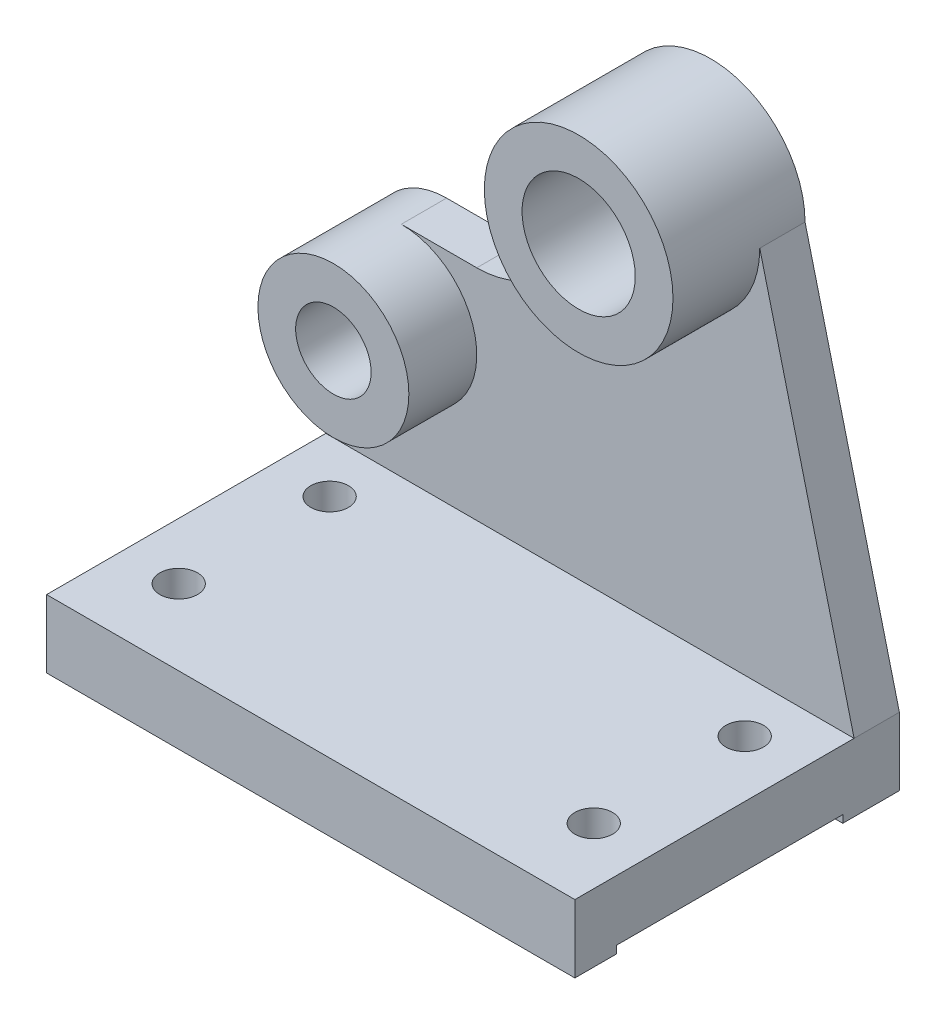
ISO-10303-21;
HEADER;
FILE_DESCRIPTION(('STEP AP214'),'2;1');
FILE_NAME('part.step','',(''),(''),'','','');
FILE_SCHEMA(('AUTOMOTIVE_DESIGN { 1 0 10303 214 1 1 1 1 }'));
ENDSEC;
DATA;
#1=APPLICATION_CONTEXT('core data for automotive mechanical design processes');
#2=APPLICATION_PROTOCOL_DEFINITION('international standard','automotive_design',2000,#1);
#3=PRODUCT_CONTEXT('',#1,'mechanical');
#4=PRODUCT('Part','Part','',(#3));
#5=PRODUCT_RELATED_PRODUCT_CATEGORY('part','',(#4));
#6=PRODUCT_DEFINITION_FORMATION('','',#4);
#7=PRODUCT_DEFINITION_CONTEXT('part definition',#1,'design');
#8=PRODUCT_DEFINITION('design','',#6,#7);
#9=PRODUCT_DEFINITION_SHAPE('','',#8);
#10=(LENGTH_UNIT() NAMED_UNIT(*) SI_UNIT(.MILLI.,.METRE.));
#11=(NAMED_UNIT(*) PLANE_ANGLE_UNIT() SI_UNIT($,.RADIAN.));
#12=(NAMED_UNIT(*) SI_UNIT($,.STERADIAN.) SOLID_ANGLE_UNIT());
#13=UNCERTAINTY_MEASURE_WITH_UNIT(LENGTH_MEASURE(1.E-05),#10,'distance_accuracy_value','');
#14=(GEOMETRIC_REPRESENTATION_CONTEXT(3) GLOBAL_UNCERTAINTY_ASSIGNED_CONTEXT((#13)) GLOBAL_UNIT_ASSIGNED_CONTEXT((#10,
#11,#12)) REPRESENTATION_CONTEXT('',''));
#15=CARTESIAN_POINT('',(0.,0.,0.));
#16=DIRECTION('',(0.,0.,1.));
#17=DIRECTION('',(1.,0.,0.));
#18=AXIS2_PLACEMENT_3D('',#15,#16,#17);
#19=CARTESIAN_POINT('',(11.4744833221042,0.,86.));
#20=DIRECTION('',(0.,1.,0.));
#21=DIRECTION('',(-1.,0.,0.));
#22=AXIS2_PLACEMENT_3D('',#19,#20,#21);
#23=PLANE('',#22);
#24=DIRECTION('',(0.,0.,-1.));
#25=VECTOR('',#24,1.);
#26=CARTESIAN_POINT('',(-70.,0.,86.));
#27=LINE('',#26,#25);
#28=CARTESIAN_POINT('',(-70.,0.,86.));
#29=VERTEX_POINT('',#28);
#30=CARTESIAN_POINT('',(-70.,0.,75.));
#31=VERTEX_POINT('',#30);
#32=EDGE_CURVE('E156',#29,#31,#27,.T.);
#33=ORIENTED_EDGE('',*,*,#32,.T.);
#34=DIRECTION('',(1.,0.,0.));
#35=VECTOR('',#34,1.);
#36=CARTESIAN_POINT('',(-70.00005,0.,75.));
#37=LINE('',#36,#35);
#38=CARTESIAN_POINT('',(70.,0.,75.));
#39=VERTEX_POINT('',#38);
#40=EDGE_CURVE('E140',#31,#39,#37,.T.);
#41=ORIENTED_EDGE('',*,*,#40,.T.);
#42=DIRECTION('',(0.,0.,-1.));
#43=VECTOR('',#42,1.);
#44=CARTESIAN_POINT('',(70.,0.,86.));
#45=LINE('',#44,#43);
#46=CARTESIAN_POINT('',(70.,0.,86.));
#47=VERTEX_POINT('',#46);
#48=EDGE_CURVE('E155',#47,#39,#45,.T.);
#49=ORIENTED_EDGE('',*,*,#48,.F.);
#50=DIRECTION('',(1.,0.,0.));
#51=VECTOR('',#50,1.);
#52=CARTESIAN_POINT('',(11.4744833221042,0.,86.));
#53=LINE('',#52,#51);
#54=EDGE_CURVE('E182',#29,#47,#53,.T.);
#55=ORIENTED_EDGE('',*,*,#54,.F.);
#56=EDGE_LOOP('',(#33,#41,#49,#55));
#57=FACE_BOUND('',#56,.T.);
#58=ADVANCED_FACE('F33',(#57),#23,.F.);
#59=CARTESIAN_POINT('',(70.,0.,15.));
#60=VERTEX_POINT('',#59);
#61=CARTESIAN_POINT('',(70.,0.,0.));
#62=VERTEX_POINT('',#61);
#63=EDGE_CURVE('E165',#60,#62,#45,.T.);
#64=ORIENTED_EDGE('',*,*,#63,.F.);
#65=DIRECTION('',(1.,0.,0.));
#66=VECTOR('',#65,1.);
#67=CARTESIAN_POINT('',(-70.00005,0.,15.));
#68=LINE('',#67,#66);
#69=CARTESIAN_POINT('',(-70.,0.,15.));
#70=VERTEX_POINT('',#69);
#71=EDGE_CURVE('E157',#70,#60,#68,.T.);
#72=ORIENTED_EDGE('',*,*,#71,.F.);
#73=CARTESIAN_POINT('',(-70.,0.,0.));
#74=VERTEX_POINT('',#73);
#75=EDGE_CURVE('E179',#70,#74,#27,.T.);
#76=ORIENTED_EDGE('',*,*,#75,.T.);
#77=DIRECTION('',(1.,0.,0.));
#78=VECTOR('',#77,1.);
#79=CARTESIAN_POINT('',(11.4744833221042,0.,0.));
#80=LINE('',#79,#78);
#81=EDGE_CURVE('E185',#74,#62,#80,.T.);
#82=ORIENTED_EDGE('',*,*,#81,.T.);
#83=EDGE_LOOP('',(#64,#72,#76,#82));
#84=FACE_BOUND('',#83,.T.);
#85=ADVANCED_FACE('F35',(#84),#23,.F.);
#86=CARTESIAN_POINT('',(70.,-156.788360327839,86.));
#87=DIRECTION('',(-1.,0.,0.));
#88=DIRECTION('',(0.,0.,1.));
#89=AXIS2_PLACEMENT_3D('',#86,#87,#88);
#90=PLANE('',#89);
#91=ORIENTED_EDGE('',*,*,#48,.T.);
#92=DIRECTION('',(0.,-1.,0.));
#93=VECTOR('',#92,1.);
#94=CARTESIAN_POINT('',(70.,0.,75.));
#95=LINE('',#94,#93);
#96=CARTESIAN_POINT('',(70.,2.00000000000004,75.));
#97=VERTEX_POINT('',#96);
#98=EDGE_CURVE('E137',#97,#39,#95,.T.);
#99=ORIENTED_EDGE('',*,*,#98,.F.);
#100=DIRECTION('',(0.,0.,1.));
#101=VECTOR('',#100,1.);
#102=CARTESIAN_POINT('',(70.,2.00000000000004,75.));
#103=LINE('',#102,#101);
#104=CARTESIAN_POINT('',(70.,2.00000000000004,15.));
#105=VERTEX_POINT('',#104);
#106=EDGE_CURVE('E158',#105,#97,#103,.T.);
#107=ORIENTED_EDGE('',*,*,#106,.F.);
#108=DIRECTION('',(0.,1.,0.));
#109=VECTOR('',#108,1.);
#110=CARTESIAN_POINT('',(70.,0.,15.));
#111=LINE('',#110,#109);
#112=EDGE_CURVE('E148',#60,#105,#111,.T.);
#113=ORIENTED_EDGE('',*,*,#112,.F.);
#114=ORIENTED_EDGE('',*,*,#63,.T.);
#115=DIRECTION('',(0.,1.,0.));
#116=VECTOR('',#115,1.);
#117=CARTESIAN_POINT('',(70.,-156.788360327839,0.));
#118=LINE('',#117,#116);
#119=CARTESIAN_POINT('',(70.,18.,0.));
#120=VERTEX_POINT('',#119);
#121=EDGE_CURVE('E183',#62,#120,#118,.T.);
#122=ORIENTED_EDGE('',*,*,#121,.T.);
#123=DIRECTION('',(0.,0.,-1.));
#124=VECTOR('',#123,1.);
#125=CARTESIAN_POINT('',(70.,18.,12.));
#126=LINE('',#125,#124);
#127=CARTESIAN_POINT('',(70.,18.,12.));
#128=VERTEX_POINT('',#127);
#129=EDGE_CURVE('E204',#128,#120,#126,.T.);
#130=ORIENTED_EDGE('',*,*,#129,.F.);
#131=DIRECTION('',(0.,0.,-1.));
#132=VECTOR('',#131,1.);
#133=CARTESIAN_POINT('',(70.,18.,86.));
#134=LINE('',#133,#132);
#135=CARTESIAN_POINT('',(70.,18.,86.));
#136=VERTEX_POINT('',#135);
#137=EDGE_CURVE('E168',#136,#128,#134,.T.);
#138=ORIENTED_EDGE('',*,*,#137,.F.);
#139=DIRECTION('',(0.,1.,0.));
#140=VECTOR('',#139,1.);
#141=CARTESIAN_POINT('',(70.,-156.788360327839,86.));
#142=LINE('',#141,#140);
#143=EDGE_CURVE('E162',#47,#136,#142,.T.);
#144=ORIENTED_EDGE('',*,*,#143,.F.);
#145=EDGE_LOOP('',(#91,#99,#107,#113,#114,#122,#130,#138,#144));
#146=FACE_BOUND('',#145,.T.);
#147=ADVANCED_FACE('F160',(#146),#90,.F.);
#148=CARTESIAN_POINT('',(11.4744833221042,18.,86.));
#149=DIRECTION('',(0.,1.,0.));
#150=DIRECTION('',(-1.,0.,0.));
#151=AXIS2_PLACEMENT_3D('',#148,#149,#150);
#152=PLANE('',#151);
#153=CARTESIAN_POINT('',(55.,18.,26.));
#154=DIRECTION('',(0.,1.,0.));
#155=DIRECTION('',(-1.,0.,0.));
#156=AXIS2_PLACEMENT_3D('',#153,#154,#155);
#157=CIRCLE('',#156,5.);
#158=CARTESIAN_POINT('',(50.,18.,26.));
#159=VERTEX_POINT('',#158);
#160=EDGE_CURVE('E269',#159,#159,#157,.T.);
#161=ORIENTED_EDGE('',*,*,#160,.F.);
#162=EDGE_LOOP('',(#161));
#163=FACE_BOUND('',#162,.T.);
#164=CARTESIAN_POINT('',(55.,18.,66.));
#165=DIRECTION('',(0.,1.,0.));
#166=DIRECTION('',(-1.,0.,0.));
#167=AXIS2_PLACEMENT_3D('',#164,#165,#166);
#168=CIRCLE('',#167,5.);
#169=CARTESIAN_POINT('',(50.,18.,66.));
#170=VERTEX_POINT('',#169);
#171=EDGE_CURVE('E259',#170,#170,#168,.T.);
#172=ORIENTED_EDGE('',*,*,#171,.F.);
#173=EDGE_LOOP('',(#172));
#174=FACE_BOUND('',#173,.T.);
#175=CARTESIAN_POINT('',(-55.,18.,26.));
#176=DIRECTION('',(0.,1.,0.));
#177=DIRECTION('',(-1.,0.,0.));
#178=AXIS2_PLACEMENT_3D('',#175,#176,#177);
#179=CIRCLE('',#178,5.);
#180=CARTESIAN_POINT('',(-60.,18.,26.));
#181=VERTEX_POINT('',#180);
#182=EDGE_CURVE('E256',#181,#181,#179,.T.);
#183=ORIENTED_EDGE('',*,*,#182,.F.);
#184=EDGE_LOOP('',(#183));
#185=FACE_BOUND('',#184,.T.);
#186=CARTESIAN_POINT('',(-55.,18.,66.));
#187=DIRECTION('',(0.,1.,0.));
#188=DIRECTION('',(-1.,0.,0.));
#189=AXIS2_PLACEMENT_3D('',#186,#187,#188);
#190=CIRCLE('',#189,5.);
#191=CARTESIAN_POINT('',(-60.,18.,66.));
#192=VERTEX_POINT('',#191);
#193=EDGE_CURVE('E253',#192,#192,#190,.T.);
#194=ORIENTED_EDGE('',*,*,#193,.F.);
#195=EDGE_LOOP('',(#194));
#196=FACE_BOUND('',#195,.T.);
#197=DIRECTION('',(1.,0.,0.));
#198=VECTOR('',#197,1.);
#199=CARTESIAN_POINT('',(11.4744833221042,18.,12.));
#200=LINE('',#199,#198);
#201=CARTESIAN_POINT('',(-70.,18.,12.));
#202=VERTEX_POINT('',#201);
#203=EDGE_CURVE('E58',#202,#128,#200,.T.);
#204=ORIENTED_EDGE('',*,*,#203,.F.);
#205=DIRECTION('',(0.,0.,-1.));
#206=VECTOR('',#205,1.);
#207=CARTESIAN_POINT('',(-70.,18.,86.));
#208=LINE('',#207,#206);
#209=CARTESIAN_POINT('',(-70.,18.,86.));
#210=VERTEX_POINT('',#209);
#211=EDGE_CURVE('E173',#210,#202,#208,.T.);
#212=ORIENTED_EDGE('',*,*,#211,.F.);
#213=DIRECTION('',(1.,0.,0.));
#214=VECTOR('',#213,1.);
#215=CARTESIAN_POINT('',(11.4744833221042,18.,86.));
#216=LINE('',#215,#214);
#217=EDGE_CURVE('E192',#210,#136,#216,.T.);
#218=ORIENTED_EDGE('',*,*,#217,.T.);
#219=ORIENTED_EDGE('',*,*,#137,.T.);
#220=EDGE_LOOP('',(#204,#212,#218,#219));
#221=FACE_BOUND('',#220,.T.);
#222=ADVANCED_FACE('F321',(#163,#174,#185,#196,#221),#152,.T.);
#223=CARTESIAN_POINT('',(-70.,-156.788360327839,86.));
#224=DIRECTION('',(-1.,0.,0.));
#225=DIRECTION('',(0.,0.,1.));
#226=AXIS2_PLACEMENT_3D('',#223,#224,#225);
#227=PLANE('',#226);
#228=DIRECTION('',(0.,1.,0.));
#229=VECTOR('',#228,1.);
#230=CARTESIAN_POINT('',(-70.,-156.788360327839,75.));
#231=LINE('',#230,#229);
#232=CARTESIAN_POINT('',(-70.,2.00000000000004,75.));
#233=VERTEX_POINT('',#232);
#234=EDGE_CURVE('E11',#31,#233,#231,.T.);
#235=ORIENTED_EDGE('',*,*,#234,.F.);
#236=ORIENTED_EDGE('',*,*,#32,.F.);
#237=DIRECTION('',(0.,1.,0.));
#238=VECTOR('',#237,1.);
#239=CARTESIAN_POINT('',(-70.,-156.788360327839,86.));
#240=LINE('',#239,#238);
#241=EDGE_CURVE('E189',#29,#210,#240,.T.);
#242=ORIENTED_EDGE('',*,*,#241,.T.);
#243=ORIENTED_EDGE('',*,*,#211,.T.);
#244=DIRECTION('',(0.,1.,0.));
#245=VECTOR('',#244,1.);
#246=CARTESIAN_POINT('',(-70.,-156.788360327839,12.));
#247=LINE('',#246,#245);
#248=CARTESIAN_POINT('',(-70.,56.,12.));
#249=VERTEX_POINT('',#248);
#250=EDGE_CURVE('E237',#202,#249,#247,.T.);
#251=ORIENTED_EDGE('',*,*,#250,.T.);
#252=DIRECTION('',(0.,0.,-1.));
#253=VECTOR('',#252,1.);
#254=CARTESIAN_POINT('',(-70.,56.,12.));
#255=LINE('',#254,#253);
#256=CARTESIAN_POINT('',(-70.,56.,0.));
#257=VERTEX_POINT('',#256);
#258=EDGE_CURVE('E201',#249,#257,#255,.T.);
#259=ORIENTED_EDGE('',*,*,#258,.T.);
#260=DIRECTION('',(0.,1.,0.));
#261=VECTOR('',#260,1.);
#262=CARTESIAN_POINT('',(-70.,-156.788360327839,0.));
#263=LINE('',#262,#261);
#264=EDGE_CURVE('E180',#74,#257,#263,.T.);
#265=ORIENTED_EDGE('',*,*,#264,.F.);
#266=ORIENTED_EDGE('',*,*,#75,.F.);
#267=DIRECTION('',(0.,-1.,0.));
#268=VECTOR('',#267,1.);
#269=CARTESIAN_POINT('',(-70.,-156.788360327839,15.));
#270=LINE('',#269,#268);
#271=CARTESIAN_POINT('',(-70.,2.00000000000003,15.));
#272=VERTEX_POINT('',#271);
#273=EDGE_CURVE('E164',#272,#70,#270,.T.);
#274=ORIENTED_EDGE('',*,*,#273,.F.);
#275=DIRECTION('',(0.,0.,-1.));
#276=VECTOR('',#275,1.);
#277=CARTESIAN_POINT('',(-70.,2.00000000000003,86.));
#278=LINE('',#277,#276);
#279=EDGE_CURVE('E42',#233,#272,#278,.T.);
#280=ORIENTED_EDGE('',*,*,#279,.F.);
#281=EDGE_LOOP('',(#235,#236,#242,#243,#251,#259,#265,#266,#274,#280));
#282=FACE_BOUND('',#281,.T.);
#283=ADVANCED_FACE('F317',(#282),#227,.T.);
#284=CARTESIAN_POINT('',(11.4744833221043,-156.788360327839,86.));
#285=DIRECTION('',(0.,0.,1.));
#286=DIRECTION('',(1.,0.,0.));
#287=AXIS2_PLACEMENT_3D('',#284,#285,#286);
#288=PLANE('',#287);
#289=ORIENTED_EDGE('',*,*,#54,.T.);
#290=ORIENTED_EDGE('',*,*,#143,.T.);
#291=ORIENTED_EDGE('',*,*,#217,.F.);
#292=ORIENTED_EDGE('',*,*,#241,.F.);
#293=EDGE_LOOP('',(#289,#290,#291,#292));
#294=FACE_BOUND('',#293,.T.);
#295=ADVANCED_FACE('F323',(#294),#288,.T.);
#296=CARTESIAN_POINT('',(11.4744833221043,-156.788360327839,0.));
#297=DIRECTION('',(0.,0.,1.));
#298=DIRECTION('',(1.,0.,0.));
#299=AXIS2_PLACEMENT_3D('',#296,#297,#298);
#300=PLANE('',#299);
#301=ORIENTED_EDGE('',*,*,#81,.F.);
#302=ORIENTED_EDGE('',*,*,#264,.T.);
#303=CARTESIAN_POINT('',(-50.,56.,0.));
#304=DIRECTION('',(0.,0.,1.));
#305=DIRECTION('',(1.,0.,0.));
#306=AXIS2_PLACEMENT_3D('',#303,#304,#305);
#307=CIRCLE('',#306,20.);
#308=CARTESIAN_POINT('',(-50.,76.,0.));
#309=VERTEX_POINT('',#308);
#310=EDGE_CURVE('E284',#309,#257,#307,.T.);
#311=ORIENTED_EDGE('',*,*,#310,.F.);
#312=DIRECTION('',(1.,0.,0.));
#313=VECTOR('',#312,1.);
#314=CARTESIAN_POINT('',(11.4744833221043,76.,0.));
#315=LINE('',#314,#313);
#316=CARTESIAN_POINT('',(-30.,76.,0.));
#317=VERTEX_POINT('',#316);
#318=EDGE_CURVE('E219',#309,#317,#315,.T.);
#319=ORIENTED_EDGE('',*,*,#318,.T.);
#320=CARTESIAN_POINT('',(-30.,101.,0.));
#321=DIRECTION('',(0.,0.,1.));
#322=DIRECTION('',(1.,0.,0.));
#323=AXIS2_PLACEMENT_3D('',#320,#321,#322);
#324=CIRCLE('',#323,25.);
#325=CARTESIAN_POINT('',(-5.00000000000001,101.,0.));
#326=VERTEX_POINT('',#325);
#327=EDGE_CURVE('E222',#317,#326,#324,.T.);
#328=ORIENTED_EDGE('',*,*,#327,.T.);
#329=DIRECTION('',(0.,1.,0.));
#330=VECTOR('',#329,1.);
#331=CARTESIAN_POINT('',(-5.00000000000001,-156.788360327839,0.));
#332=LINE('',#331,#330);
#333=CARTESIAN_POINT('',(-5.00000000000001,118.,0.));
#334=VERTEX_POINT('',#333);
#335=EDGE_CURVE('E213',#326,#334,#332,.T.);
#336=ORIENTED_EDGE('',*,*,#335,.T.);
#337=CARTESIAN_POINT('',(20.,118.,0.));
#338=DIRECTION('',(0.,0.,1.));
#339=DIRECTION('',(1.,0.,0.));
#340=AXIS2_PLACEMENT_3D('',#337,#338,#339);
#341=CIRCLE('',#340,25.);
#342=CARTESIAN_POINT('',(45.,118.,0.));
#343=VERTEX_POINT('',#342);
#344=EDGE_CURVE('E295',#343,#334,#341,.T.);
#345=ORIENTED_EDGE('',*,*,#344,.F.);
#346=DIRECTION('',(-0.242535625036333,0.970142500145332,0.));
#347=VECTOR('',#346,1.);
#348=CARTESIAN_POINT('',(107.683995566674,-132.735982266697,0.));
#349=LINE('',#348,#347);
#350=EDGE_CURVE('E217',#120,#343,#349,.T.);
#351=ORIENTED_EDGE('',*,*,#350,.F.);
#352=ORIENTED_EDGE('',*,*,#121,.F.);
#353=EDGE_LOOP('',(#301,#302,#311,#319,#328,#336,#345,#351,#352));
#354=FACE_BOUND('',#353,.T.);
#355=CARTESIAN_POINT('',(20.,118.,0.));
#356=DIRECTION('',(0.,0.,1.));
#357=DIRECTION('',(1.,0.,0.));
#358=AXIS2_PLACEMENT_3D('',#355,#356,#357);
#359=CIRCLE('',#358,15.);
#360=CARTESIAN_POINT('',(35.,118.,0.));
#361=VERTEX_POINT('',#360);
#362=EDGE_CURVE('E287',#361,#361,#359,.T.);
#363=ORIENTED_EDGE('',*,*,#362,.T.);
#364=EDGE_LOOP('',(#363));
#365=FACE_BOUND('',#364,.T.);
#366=CARTESIAN_POINT('',(-50.,56.,0.));
#367=DIRECTION('',(0.,0.,1.));
#368=DIRECTION('',(1.,0.,0.));
#369=AXIS2_PLACEMENT_3D('',#366,#367,#368);
#370=CIRCLE('',#369,10.);
#371=CARTESIAN_POINT('',(-40.,56.,0.));
#372=VERTEX_POINT('',#371);
#373=EDGE_CURVE('E277',#372,#372,#370,.T.);
#374=ORIENTED_EDGE('',*,*,#373,.T.);
#375=EDGE_LOOP('',(#374));
#376=FACE_BOUND('',#375,.T.);
#377=ADVANCED_FACE('F336',(#354,#365,#376),#300,.F.);
#378=CARTESIAN_POINT('',(-30.,101.,12.));
#379=DIRECTION('',(0.,0.,-1.));
#380=DIRECTION('',(-1.,0.,0.));
#381=AXIS2_PLACEMENT_3D('',#378,#379,#380);
#382=CYLINDRICAL_SURFACE('',#381,25.);
#383=ORIENTED_EDGE('',*,*,#327,.F.);
#384=DIRECTION('',(0.,0.,-1.));
#385=VECTOR('',#384,1.);
#386=CARTESIAN_POINT('',(-30.,76.,12.));
#387=LINE('',#386,#385);
#388=CARTESIAN_POINT('',(-30.,76.,12.));
#389=VERTEX_POINT('',#388);
#390=EDGE_CURVE('E188',#389,#317,#387,.T.);
#391=ORIENTED_EDGE('',*,*,#390,.F.);
#392=CARTESIAN_POINT('',(-30.,101.,12.));
#393=DIRECTION('',(0.,0.,1.));
#394=DIRECTION('',(1.,0.,0.));
#395=AXIS2_PLACEMENT_3D('',#392,#393,#394);
#396=CIRCLE('',#395,25.);
#397=CARTESIAN_POINT('',(-5.00000000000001,101.,12.));
#398=VERTEX_POINT('',#397);
#399=EDGE_CURVE('E216',#389,#398,#396,.T.);
#400=ORIENTED_EDGE('',*,*,#399,.T.);
#401=DIRECTION('',(0.,0.,-1.));
#402=VECTOR('',#401,1.);
#403=CARTESIAN_POINT('',(-5.00000000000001,101.,12.));
#404=LINE('',#403,#402);
#405=EDGE_CURVE('E210',#398,#326,#404,.T.);
#406=ORIENTED_EDGE('',*,*,#405,.T.);
#407=EDGE_LOOP('',(#383,#391,#400,#406));
#408=FACE_BOUND('',#407,.T.);
#409=ADVANCED_FACE('F344',(#408),#382,.F.);
#410=CARTESIAN_POINT('',(11.4744833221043,76.,12.));
#411=DIRECTION('',(0.,1.,0.));
#412=DIRECTION('',(0.,0.,1.));
#413=AXIS2_PLACEMENT_3D('',#410,#411,#412);
#414=PLANE('',#413);
#415=ORIENTED_EDGE('',*,*,#318,.F.);
#416=DIRECTION('',(0.,0.,-1.));
#417=VECTOR('',#416,1.);
#418=CARTESIAN_POINT('',(-50.,76.,12.));
#419=LINE('',#418,#417);
#420=CARTESIAN_POINT('',(-50.,76.,12.));
#421=VERTEX_POINT('',#420);
#422=EDGE_CURVE('E198',#421,#309,#419,.T.);
#423=ORIENTED_EDGE('',*,*,#422,.F.);
#424=DIRECTION('',(1.,0.,0.));
#425=VECTOR('',#424,1.);
#426=CARTESIAN_POINT('',(11.4744833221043,76.,12.));
#427=LINE('',#426,#425);
#428=EDGE_CURVE('E303',#421,#389,#427,.T.);
#429=ORIENTED_EDGE('',*,*,#428,.T.);
#430=ORIENTED_EDGE('',*,*,#390,.T.);
#431=EDGE_LOOP('',(#415,#423,#429,#430));
#432=FACE_BOUND('',#431,.T.);
#433=ADVANCED_FACE('F345',(#432),#414,.T.);
#434=CARTESIAN_POINT('',(107.683995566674,-132.735982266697,12.));
#435=DIRECTION('',(-0.970142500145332,-0.242535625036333,0.));
#436=DIRECTION('',(0.242535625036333,-0.970142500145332,0.));
#437=AXIS2_PLACEMENT_3D('',#434,#435,#436);
#438=PLANE('',#437);
#439=ORIENTED_EDGE('',*,*,#350,.T.);
#440=DIRECTION('',(0.,0.,-1.));
#441=VECTOR('',#440,1.);
#442=CARTESIAN_POINT('',(45.,118.,12.));
#443=LINE('',#442,#441);
#444=CARTESIAN_POINT('',(45.,118.,12.));
#445=VERTEX_POINT('',#444);
#446=EDGE_CURVE('E205',#445,#343,#443,.T.);
#447=ORIENTED_EDGE('',*,*,#446,.F.);
#448=DIRECTION('',(-0.242535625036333,0.970142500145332,0.));
#449=VECTOR('',#448,1.);
#450=CARTESIAN_POINT('',(107.683995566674,-132.735982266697,12.));
#451=LINE('',#450,#449);
#452=EDGE_CURVE('E231',#128,#445,#451,.T.);
#453=ORIENTED_EDGE('',*,*,#452,.F.);
#454=ORIENTED_EDGE('',*,*,#129,.T.);
#455=EDGE_LOOP('',(#439,#447,#453,#454));
#456=FACE_BOUND('',#455,.T.);
#457=ADVANCED_FACE('F329',(#456),#438,.F.);
#458=CARTESIAN_POINT('',(-5.00000000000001,-156.788360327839,12.));
#459=DIRECTION('',(-1.,0.,0.));
#460=DIRECTION('',(0.,0.,1.));
#461=AXIS2_PLACEMENT_3D('',#458,#459,#460);
#462=PLANE('',#461);
#463=ORIENTED_EDGE('',*,*,#335,.F.);
#464=ORIENTED_EDGE('',*,*,#405,.F.);
#465=DIRECTION('',(0.,1.,0.));
#466=VECTOR('',#465,1.);
#467=CARTESIAN_POINT('',(-5.00000000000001,-156.788360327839,12.));
#468=LINE('',#467,#466);
#469=CARTESIAN_POINT('',(-5.00000000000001,118.,12.));
#470=VERTEX_POINT('',#469);
#471=EDGE_CURVE('E212',#398,#470,#468,.T.);
#472=ORIENTED_EDGE('',*,*,#471,.T.);
#473=DIRECTION('',(0.,0.,-1.));
#474=VECTOR('',#473,1.);
#475=CARTESIAN_POINT('',(-5.00000000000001,118.,12.));
#476=LINE('',#475,#474);
#477=EDGE_CURVE('E208',#470,#334,#476,.T.);
#478=ORIENTED_EDGE('',*,*,#477,.T.);
#479=EDGE_LOOP('',(#463,#464,#472,#478));
#480=FACE_BOUND('',#479,.T.);
#481=ADVANCED_FACE('F341',(#480),#462,.T.);
#482=CARTESIAN_POINT('',(11.4744833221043,-156.788360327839,12.));
#483=DIRECTION('',(0.,0.,1.));
#484=DIRECTION('',(1.,0.,0.));
#485=AXIS2_PLACEMENT_3D('',#482,#483,#484);
#486=PLANE('',#485);
#487=ORIENTED_EDGE('',*,*,#399,.F.);
#488=ORIENTED_EDGE('',*,*,#428,.F.);
#489=CARTESIAN_POINT('',(-50.,56.,12.));
#490=DIRECTION('',(0.,0.,1.));
#491=DIRECTION('',(1.,0.,0.));
#492=AXIS2_PLACEMENT_3D('',#489,#490,#491);
#493=CIRCLE('',#492,20.);
#494=EDGE_CURVE('E234',#249,#421,#493,.T.);
#495=ORIENTED_EDGE('',*,*,#494,.F.);
#496=ORIENTED_EDGE('',*,*,#250,.F.);
#497=ORIENTED_EDGE('',*,*,#203,.T.);
#498=ORIENTED_EDGE('',*,*,#452,.T.);
#499=CARTESIAN_POINT('',(20.,118.,12.));
#500=DIRECTION('',(0.,0.,1.));
#501=DIRECTION('',(1.,0.,0.));
#502=AXIS2_PLACEMENT_3D('',#499,#500,#501);
#503=CIRCLE('',#502,25.);
#504=EDGE_CURVE('E228',#470,#445,#503,.T.);
#505=ORIENTED_EDGE('',*,*,#504,.F.);
#506=ORIENTED_EDGE('',*,*,#471,.F.);
#507=EDGE_LOOP('',(#487,#488,#495,#496,#497,#498,#505,#506));
#508=FACE_BOUND('',#507,.T.);
#509=ADVANCED_FACE('F315',(#508),#486,.T.);
#510=CARTESIAN_POINT('',(20.,118.,35.));
#511=DIRECTION('',(0.,0.,-1.));
#512=DIRECTION('',(-1.,0.,0.));
#513=AXIS2_PLACEMENT_3D('',#510,#511,#512);
#514=CYLINDRICAL_SURFACE('',#513,25.);
#515=CARTESIAN_POINT('',(20.,118.,35.));
#516=DIRECTION('',(0.,0.,1.));
#517=DIRECTION('',(1.,0.,0.));
#518=AXIS2_PLACEMENT_3D('',#515,#516,#517);
#519=CIRCLE('',#518,25.);
#520=CARTESIAN_POINT('',(45.,118.,35.));
#521=VERTEX_POINT('',#520);
#522=EDGE_CURVE('E225',#521,#521,#519,.T.);
#523=ORIENTED_EDGE('',*,*,#522,.F.);
#524=EDGE_LOOP('',(#523));
#525=FACE_BOUND('',#524,.T.);
#526=ORIENTED_EDGE('',*,*,#504,.T.);
#527=ORIENTED_EDGE('',*,*,#446,.T.);
#528=ORIENTED_EDGE('',*,*,#344,.T.);
#529=ORIENTED_EDGE('',*,*,#477,.F.);
#530=EDGE_LOOP('',(#526,#527,#528,#529));
#531=FACE_BOUND('',#530,.T.);
#532=ADVANCED_FACE('F332',(#525,#531),#514,.T.);
#533=CARTESIAN_POINT('',(20.,118.,35.));
#534=DIRECTION('',(0.,0.,-1.));
#535=DIRECTION('',(-1.,0.,0.));
#536=AXIS2_PLACEMENT_3D('',#533,#534,#535);
#537=CYLINDRICAL_SURFACE('',#536,15.);
#538=CARTESIAN_POINT('',(20.,118.,35.));
#539=DIRECTION('',(0.,0.,1.));
#540=DIRECTION('',(1.,0.,0.));
#541=AXIS2_PLACEMENT_3D('',#538,#539,#540);
#542=CIRCLE('',#541,15.);
#543=CARTESIAN_POINT('',(35.,118.,35.));
#544=VERTEX_POINT('',#543);
#545=EDGE_CURVE('E292',#544,#544,#542,.T.);
#546=ORIENTED_EDGE('',*,*,#545,.T.);
#547=EDGE_LOOP('',(#546));
#548=FACE_BOUND('',#547,.T.);
#549=ORIENTED_EDGE('',*,*,#362,.F.);
#550=EDGE_LOOP('',(#549));
#551=FACE_BOUND('',#550,.T.);
#552=ADVANCED_FACE('F397',(#548,#551),#537,.F.);
#553=CARTESIAN_POINT('',(11.4744833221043,-156.788360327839,35.));
#554=DIRECTION('',(0.,0.,1.));
#555=DIRECTION('',(1.,0.,0.));
#556=AXIS2_PLACEMENT_3D('',#553,#554,#555);
#557=PLANE('',#556);
#558=ORIENTED_EDGE('',*,*,#545,.F.);
#559=EDGE_LOOP('',(#558));
#560=FACE_BOUND('',#559,.T.);
#561=ORIENTED_EDGE('',*,*,#522,.T.);
#562=EDGE_LOOP('',(#561));
#563=FACE_BOUND('',#562,.T.);
#564=ADVANCED_FACE('F400',(#560,#563),#557,.T.);
#565=CARTESIAN_POINT('',(-50.,56.,30.));
#566=DIRECTION('',(0.,0.,-1.));
#567=DIRECTION('',(-1.,0.,0.));
#568=AXIS2_PLACEMENT_3D('',#565,#566,#567);
#569=CYLINDRICAL_SURFACE('',#568,20.);
#570=CARTESIAN_POINT('',(-50.,56.,30.));
#571=DIRECTION('',(0.,0.,1.));
#572=DIRECTION('',(1.,0.,0.));
#573=AXIS2_PLACEMENT_3D('',#570,#571,#572);
#574=CIRCLE('',#573,20.);
#575=CARTESIAN_POINT('',(-30.,56.,30.));
#576=VERTEX_POINT('',#575);
#577=EDGE_CURVE('E283',#576,#576,#574,.T.);
#578=ORIENTED_EDGE('',*,*,#577,.F.);
#579=EDGE_LOOP('',(#578));
#580=FACE_BOUND('',#579,.T.);
#581=ORIENTED_EDGE('',*,*,#310,.T.);
#582=ORIENTED_EDGE('',*,*,#258,.F.);
#583=ORIENTED_EDGE('',*,*,#494,.T.);
#584=ORIENTED_EDGE('',*,*,#422,.T.);
#585=EDGE_LOOP('',(#581,#582,#583,#584));
#586=FACE_BOUND('',#585,.T.);
#587=ADVANCED_FACE('F310',(#580,#586),#569,.T.);
#588=CARTESIAN_POINT('',(-50.,56.,30.));
#589=DIRECTION('',(0.,0.,-1.));
#590=DIRECTION('',(-1.,0.,0.));
#591=AXIS2_PLACEMENT_3D('',#588,#589,#590);
#592=CYLINDRICAL_SURFACE('',#591,10.);
#593=CARTESIAN_POINT('',(-50.,56.,30.));
#594=DIRECTION('',(0.,0.,1.));
#595=DIRECTION('',(1.,0.,0.));
#596=AXIS2_PLACEMENT_3D('',#593,#594,#595);
#597=CIRCLE('',#596,10.);
#598=CARTESIAN_POINT('',(-40.,56.,30.));
#599=VERTEX_POINT('',#598);
#600=EDGE_CURVE('E280',#599,#599,#597,.T.);
#601=ORIENTED_EDGE('',*,*,#600,.T.);
#602=EDGE_LOOP('',(#601));
#603=FACE_BOUND('',#602,.T.);
#604=ORIENTED_EDGE('',*,*,#373,.F.);
#605=EDGE_LOOP('',(#604));
#606=FACE_BOUND('',#605,.T.);
#607=ADVANCED_FACE('F408',(#603,#606),#592,.F.);
#608=CARTESIAN_POINT('',(11.4744833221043,-156.788360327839,30.));
#609=DIRECTION('',(0.,0.,1.));
#610=DIRECTION('',(1.,0.,0.));
#611=AXIS2_PLACEMENT_3D('',#608,#609,#610);
#612=PLANE('',#611);
#613=ORIENTED_EDGE('',*,*,#600,.F.);
#614=EDGE_LOOP('',(#613));
#615=FACE_BOUND('',#614,.T.);
#616=ORIENTED_EDGE('',*,*,#577,.T.);
#617=EDGE_LOOP('',(#616));
#618=FACE_BOUND('',#617,.T.);
#619=ADVANCED_FACE('F365',(#615,#618),#612,.T.);
#620=CARTESIAN_POINT('',(-70.00005,0.,75.));
#621=DIRECTION('',(0.,0.,1.));
#622=DIRECTION('',(1.,0.,0.));
#623=AXIS2_PLACEMENT_3D('',#620,#621,#622);
#624=PLANE('',#623);
#625=ORIENTED_EDGE('',*,*,#234,.T.);
#626=DIRECTION('',(1.,0.,0.));
#627=VECTOR('',#626,1.);
#628=CARTESIAN_POINT('',(-70.00005,2.00000000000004,75.));
#629=LINE('',#628,#627);
#630=EDGE_CURVE('E143',#233,#97,#629,.T.);
#631=ORIENTED_EDGE('',*,*,#630,.T.);
#632=ORIENTED_EDGE('',*,*,#98,.T.);
#633=ORIENTED_EDGE('',*,*,#40,.F.);
#634=EDGE_LOOP('',(#625,#631,#632,#633));
#635=FACE_BOUND('',#634,.T.);
#636=ADVANCED_FACE('F139',(#635),#624,.F.);
#637=CARTESIAN_POINT('',(-70.00005,2.00000000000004,75.));
#638=DIRECTION('',(0.,1.,0.));
#639=DIRECTION('',(0.,0.,1.));
#640=AXIS2_PLACEMENT_3D('',#637,#638,#639);
#641=PLANE('',#640);
#642=CARTESIAN_POINT('',(55.,2.00000000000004,26.));
#643=DIRECTION('',(0.,1.,0.));
#644=DIRECTION('',(0.,0.,1.));
#645=AXIS2_PLACEMENT_3D('',#642,#643,#644);
#646=CIRCLE('',#645,5.);
#647=CARTESIAN_POINT('',(55.,2.00000000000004,31.));
#648=VERTEX_POINT('',#647);
#649=EDGE_CURVE('E37',#648,#648,#646,.T.);
#650=ORIENTED_EDGE('',*,*,#649,.T.);
#651=EDGE_LOOP('',(#650));
#652=FACE_BOUND('',#651,.T.);
#653=CARTESIAN_POINT('',(55.,2.00000000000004,66.));
#654=DIRECTION('',(0.,1.,0.));
#655=DIRECTION('',(0.,0.,1.));
#656=AXIS2_PLACEMENT_3D('',#653,#654,#655);
#657=CIRCLE('',#656,5.);
#658=CARTESIAN_POINT('',(55.,2.00000000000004,71.));
#659=VERTEX_POINT('',#658);
#660=EDGE_CURVE('E257',#659,#659,#657,.T.);
#661=ORIENTED_EDGE('',*,*,#660,.T.);
#662=EDGE_LOOP('',(#661));
#663=FACE_BOUND('',#662,.T.);
#664=CARTESIAN_POINT('',(-55.,2.00000000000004,26.));
#665=DIRECTION('',(0.,1.,0.));
#666=DIRECTION('',(0.,0.,1.));
#667=AXIS2_PLACEMENT_3D('',#664,#665,#666);
#668=CIRCLE('',#667,5.);
#669=CARTESIAN_POINT('',(-55.,2.00000000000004,31.));
#670=VERTEX_POINT('',#669);
#671=EDGE_CURVE('E254',#670,#670,#668,.T.);
#672=ORIENTED_EDGE('',*,*,#671,.T.);
#673=EDGE_LOOP('',(#672));
#674=FACE_BOUND('',#673,.T.);
#675=CARTESIAN_POINT('',(-55.,2.00000000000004,66.));
#676=DIRECTION('',(0.,1.,0.));
#677=DIRECTION('',(0.,0.,1.));
#678=AXIS2_PLACEMENT_3D('',#675,#676,#677);
#679=CIRCLE('',#678,5.);
#680=CARTESIAN_POINT('',(-55.,2.00000000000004,71.));
#681=VERTEX_POINT('',#680);
#682=EDGE_CURVE('E149',#681,#681,#679,.T.);
#683=ORIENTED_EDGE('',*,*,#682,.T.);
#684=EDGE_LOOP('',(#683));
#685=FACE_BOUND('',#684,.T.);
#686=ORIENTED_EDGE('',*,*,#279,.T.);
#687=DIRECTION('',(1.,0.,0.));
#688=VECTOR('',#687,1.);
#689=CARTESIAN_POINT('',(-70.00005,2.00000000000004,15.));
#690=LINE('',#689,#688);
#691=EDGE_CURVE('E50',#272,#105,#690,.T.);
#692=ORIENTED_EDGE('',*,*,#691,.T.);
#693=ORIENTED_EDGE('',*,*,#106,.T.);
#694=ORIENTED_EDGE('',*,*,#630,.F.);
#695=EDGE_LOOP('',(#686,#692,#693,#694));
#696=FACE_BOUND('',#695,.T.);
#697=ADVANCED_FACE('F355',(#652,#663,#674,#685,#696),#641,.F.);
#698=CARTESIAN_POINT('',(-70.00005,0.,15.));
#699=DIRECTION('',(0.,0.,-1.));
#700=DIRECTION('',(-1.,0.,0.));
#701=AXIS2_PLACEMENT_3D('',#698,#699,#700);
#702=PLANE('',#701);
#703=ORIENTED_EDGE('',*,*,#273,.T.);
#704=ORIENTED_EDGE('',*,*,#71,.T.);
#705=ORIENTED_EDGE('',*,*,#112,.T.);
#706=ORIENTED_EDGE('',*,*,#691,.F.);
#707=EDGE_LOOP('',(#703,#704,#705,#706));
#708=FACE_BOUND('',#707,.T.);
#709=ADVANCED_FACE('F353',(#708),#702,.F.);
#710=CARTESIAN_POINT('',(-55.,0.,66.));
#711=DIRECTION('',(0.,1.,0.));
#712=DIRECTION('',(-1.,0.,0.));
#713=AXIS2_PLACEMENT_3D('',#710,#711,#712);
#714=CYLINDRICAL_SURFACE('',#713,5.);
#715=ORIENTED_EDGE('',*,*,#193,.T.);
#716=EDGE_LOOP('',(#715));
#717=FACE_BOUND('',#716,.T.);
#718=ORIENTED_EDGE('',*,*,#682,.F.);
#719=EDGE_LOOP('',(#718));
#720=FACE_BOUND('',#719,.T.);
#721=ADVANCED_FACE('F363',(#717,#720),#714,.F.);
#722=CARTESIAN_POINT('',(-55.,0.,26.));
#723=DIRECTION('',(0.,1.,0.));
#724=DIRECTION('',(-1.,0.,0.));
#725=AXIS2_PLACEMENT_3D('',#722,#723,#724);
#726=CYLINDRICAL_SURFACE('',#725,5.);
#727=ORIENTED_EDGE('',*,*,#182,.T.);
#728=EDGE_LOOP('',(#727));
#729=FACE_BOUND('',#728,.T.);
#730=ORIENTED_EDGE('',*,*,#671,.F.);
#731=EDGE_LOOP('',(#730));
#732=FACE_BOUND('',#731,.T.);
#733=ADVANCED_FACE('F462',(#729,#732),#726,.F.);
#734=CARTESIAN_POINT('',(55.,0.,66.));
#735=DIRECTION('',(0.,1.,0.));
#736=DIRECTION('',(-1.,0.,0.));
#737=AXIS2_PLACEMENT_3D('',#734,#735,#736);
#738=CYLINDRICAL_SURFACE('',#737,5.);
#739=ORIENTED_EDGE('',*,*,#171,.T.);
#740=EDGE_LOOP('',(#739));
#741=FACE_BOUND('',#740,.T.);
#742=ORIENTED_EDGE('',*,*,#660,.F.);
#743=EDGE_LOOP('',(#742));
#744=FACE_BOUND('',#743,.T.);
#745=ADVANCED_FACE('F471',(#741,#744),#738,.F.);
#746=CARTESIAN_POINT('',(55.,0.,26.));
#747=DIRECTION('',(0.,1.,0.));
#748=DIRECTION('',(-1.,0.,0.));
#749=AXIS2_PLACEMENT_3D('',#746,#747,#748);
#750=CYLINDRICAL_SURFACE('',#749,5.);
#751=ORIENTED_EDGE('',*,*,#160,.T.);
#752=EDGE_LOOP('',(#751));
#753=FACE_BOUND('',#752,.T.);
#754=ORIENTED_EDGE('',*,*,#649,.F.);
#755=EDGE_LOOP('',(#754));
#756=FACE_BOUND('',#755,.T.);
#757=ADVANCED_FACE('F481',(#753,#756),#750,.F.);
#758=CLOSED_SHELL('',(#58,#85,#147,#222,#283,#295,#377,#409,#433,#457,#481,#509,#532,#552,#564,
#587,#607,#619,#636,#697,#709,#721,#733,#745,#757));
#759=MANIFOLD_SOLID_BREP('B2',#758);
#760=ADVANCED_BREP_SHAPE_REPRESENTATION('',(#18,#759),#14);
#761=SHAPE_DEFINITION_REPRESENTATION(#9,#760);
ENDSEC;
END-ISO-10303-21;
